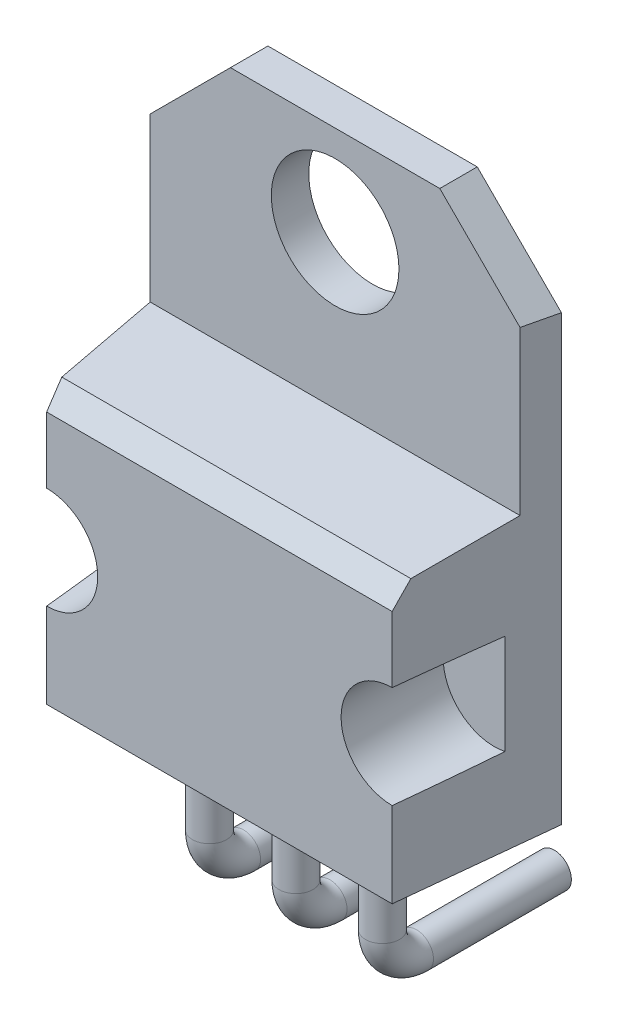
from build123d import *

# Parameters (mm, degrees)
ESQUISSE1_W             = 10.15
ESQUISSE1_H             = 15.5
EXTRUSION1_DEPTH        = 1.1
ESQUISSE2_R             = 1.875
ENL_V_MAT_EXTRU_1_DEPTH = 19.560239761
CHANFREIN1_SIZE         = 2
ESQUISSE3_W             = 10.15
ESQUISSE3_H             = 8
EXTRUSION2_DEPTH        = 3.4
ESQUISSE4_R             = 1.5
ENL_V_MAT_EXTRU_2_DEPTH = 3
D_POUILLE1_ANGLE        = 6
CHANFREIN2_SIZE         = 0.5
CHANFREIN2_SIZE2        = 0.561801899
ESQUISSE5_R             = 0.5
ESQUISSE9_R             = 0.5


with BuildPart() as part:
    # Esquisse1 → Extrusion1 (new body)
    with BuildSketch(Plane.XY):
        with Locations((5.075, 7.75)):
            Rectangle(ESQUISSE1_W, ESQUISSE1_H)
    extrude(amount=EXTRUSION1_DEPTH)

    # Esquisse2 → Enl_v. mat.-Extru.1 (cut, through all)
    with BuildSketch(Plane.XY.offset(1.1)):
        with Locations((5.075, 12.85)):
            Circle(ESQUISSE2_R)
    extrude(amount=-ENL_V_MAT_EXTRU_1_DEPTH, mode=Mode.SUBTRACT)

    # Chanfrein1
    chanfrein1_edges = [part.edges().sort_by_distance(p)[0] for p in [
        (0, 15.5, 0.55),
        (10.15, 15.5, 0.55),
    ]]
    chamfer(chanfrein1_edges, length=CHANFREIN1_SIZE)

    # Esquisse3 → Extrusion2 (add)
    with BuildSketch(Plane.XY.offset(1.1)):
        with Locations((5.075, 4)):
            Rectangle(ESQUISSE3_W, ESQUISSE3_H)
    extrude(amount=EXTRUSION2_DEPTH)

    # Esquisse4 → Enl_v. mat.-Extru.2 (cut)
    with BuildSketch(Plane.XY.offset(4.5)):
        with Locations((0, 4)):
            Circle(ESQUISSE4_R)
        with Locations((10.15, 4)):
            Circle(ESQUISSE4_R)
    extrude(amount=-ENL_V_MAT_EXTRU_2_DEPTH, mode=Mode.SUBTRACT)

    # D_pouille1
    d_pouille1_faces = [part.faces().sort_by_distance(p)[0] for p in [
        (10.15, 13.357697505, 0.55),
        (5.075, 8, 2.8),
        (0, 6.75, 0.142302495),
    ]]
    draft(d_pouille1_faces, Plane(origin=(0, 8, 4.5), x_dir=(1, 0, 0), z_dir=(0, 0, 1)), D_POUILLE1_ANGLE)

    # Chanfrein2
    chanfrein2_edges = [part.edges().sort_by_distance(p)[0] for p in [
        (5.075, 8, 4.5),
    ]]
    chanfrein2_side = [part.faces().sort_by_distance(p)[0] for p in [
        (5.075, 8.1807028, 2.780727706),
    ]]
    chamfer(chanfrein2_edges, length=CHANFREIN2_SIZE, length2=CHANFREIN2_SIZE2, reference=chanfrein2_side[0])

    # Balayage1: sweep along a path in Esquisse8
    with BuildLine(Plane(origin=(2.54, 0, 0), x_dir=(0, 0, -1), z_dir=(1, 0, 0))) as balayage1_path:
        Line((-2.25, 0), (-2.25, -3.05))
        ThreePointArc((-2.25, -3.05), (-1.957106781, -3.757106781), (-1.25, -4.05))
        Line((-1.25, -4.05), (2.8, -4.05))
    # Esquisse5 → Balayage1 (sweep)
    with BuildSketch(Plane.XZ):
        with Locations((2.535, 2.25)):
            Circle(ESQUISSE5_R)
    balayage1 = sweep(path=balayage1_path.line)

    # Balayage2: sweep along a path in Esquisse10
    with BuildLine(Plane(origin=(5.075, 0, 0), x_dir=(0, 0, -1), z_dir=(1, 0, 0))) as balayage2_path:
        Line((-2.25, 0), (-2.25, -3.05))
        ThreePointArc((-2.25, -3.05), (-1.957106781, -3.757106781), (-1.25, -4.05))
        Line((-1.25, -4.05), (2.8, -4.05))
    # Esquisse9 → Balayage2 (sweep)
    with BuildSketch(Plane.XZ):
        with Locations((5.075, 2.25)):
            Circle(ESQUISSE9_R)
    sweep(path=balayage2_path.line)

    # Sym_trie1: Balayage1 across plane
    add(balayage1.mirror(Plane(origin=(5.075, 0, 0), x_dir=(0, 0, 1), z_dir=(1, 0, 0))))


solid = part.part
